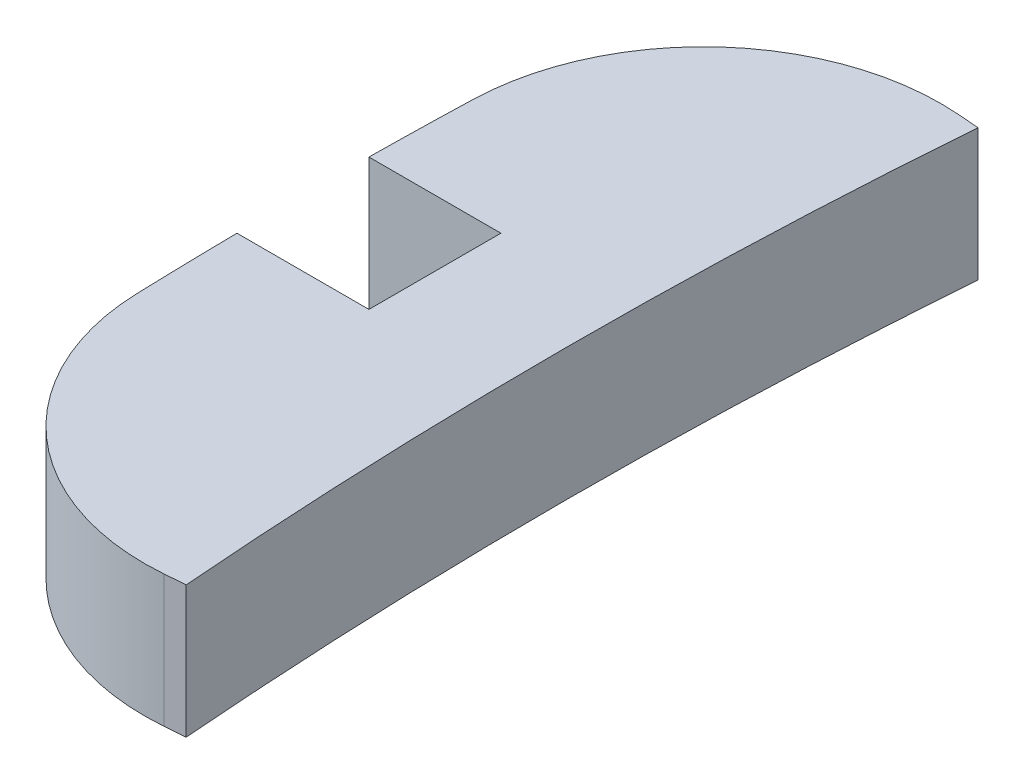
ISO-10303-21;
HEADER;
FILE_DESCRIPTION(('STEP AP214'),'2;1');
FILE_NAME('part.step','',(''),(''),'','','');
FILE_SCHEMA(('AUTOMOTIVE_DESIGN { 1 0 10303 214 1 1 1 1 }'));
ENDSEC;
DATA;
#1=APPLICATION_CONTEXT('core data for automotive mechanical design processes');
#2=APPLICATION_PROTOCOL_DEFINITION('international standard','automotive_design',2000,#1);
#3=PRODUCT_CONTEXT('',#1,'mechanical');
#4=PRODUCT('Part','Part','',(#3));
#5=PRODUCT_RELATED_PRODUCT_CATEGORY('part','',(#4));
#6=PRODUCT_DEFINITION_FORMATION('','',#4);
#7=PRODUCT_DEFINITION_CONTEXT('part definition',#1,'design');
#8=PRODUCT_DEFINITION('design','',#6,#7);
#9=PRODUCT_DEFINITION_SHAPE('','',#8);
#10=(LENGTH_UNIT() NAMED_UNIT(*) SI_UNIT(.MILLI.,.METRE.));
#11=(NAMED_UNIT(*) PLANE_ANGLE_UNIT() SI_UNIT($,.RADIAN.));
#12=(NAMED_UNIT(*) SI_UNIT($,.STERADIAN.) SOLID_ANGLE_UNIT());
#13=UNCERTAINTY_MEASURE_WITH_UNIT(LENGTH_MEASURE(1.E-05),#10,'distance_accuracy_value','');
#14=(GEOMETRIC_REPRESENTATION_CONTEXT(3) GLOBAL_UNCERTAINTY_ASSIGNED_CONTEXT((#13)) GLOBAL_UNIT_ASSIGNED_CONTEXT((#10,
#11,#12)) REPRESENTATION_CONTEXT('',''));
#15=CARTESIAN_POINT('',(0.,0.,0.));
#16=DIRECTION('',(0.,0.,1.));
#17=DIRECTION('',(1.,0.,0.));
#18=AXIS2_PLACEMENT_3D('',#15,#16,#17);
#19=CARTESIAN_POINT('',(-195.684428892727,5.,-2.5));
#20=DIRECTION('',(1.,0.,0.));
#21=DIRECTION('',(0.,0.,-1.));
#22=AXIS2_PLACEMENT_3D('',#19,#20,#21);
#23=PLANE('',#22);
#24=DIRECTION('',(0.,0.,1.));
#25=VECTOR('',#24,1.);
#26=CARTESIAN_POINT('',(-195.684428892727,0.,-2.5));
#27=LINE('',#26,#25);
#28=CARTESIAN_POINT('',(-195.684428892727,0.,-2.5));
#29=VERTEX_POINT('',#28);
#30=CARTESIAN_POINT('',(-195.684428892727,0.,2.5));
#31=VERTEX_POINT('',#30);
#32=EDGE_CURVE('E141',#29,#31,#27,.T.);
#33=ORIENTED_EDGE('',*,*,#32,.T.);
#34=DIRECTION('',(0.,-1.,0.));
#35=VECTOR('',#34,1.);
#36=CARTESIAN_POINT('',(-195.684428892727,5.,2.5));
#37=LINE('',#36,#35);
#38=CARTESIAN_POINT('',(-195.684428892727,5.,2.5));
#39=VERTEX_POINT('',#38);
#40=EDGE_CURVE('E11',#39,#31,#37,.T.);
#41=ORIENTED_EDGE('',*,*,#40,.F.);
#42=DIRECTION('',(0.,0.,1.));
#43=VECTOR('',#42,1.);
#44=CARTESIAN_POINT('',(-195.684428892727,5.,-2.5));
#45=LINE('',#44,#43);
#46=CARTESIAN_POINT('',(-195.684428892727,5.,-2.5));
#47=VERTEX_POINT('',#46);
#48=EDGE_CURVE('E159',#47,#39,#45,.T.);
#49=ORIENTED_EDGE('',*,*,#48,.F.);
#50=DIRECTION('',(0.,-1.,0.));
#51=VECTOR('',#50,1.);
#52=CARTESIAN_POINT('',(-195.684428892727,5.,-2.5));
#53=LINE('',#52,#51);
#54=EDGE_CURVE('E137',#47,#29,#53,.T.);
#55=ORIENTED_EDGE('',*,*,#54,.T.);
#56=EDGE_LOOP('',(#33,#41,#49,#55));
#57=FACE_BOUND('',#56,.T.);
#58=ADVANCED_FACE('F33',(#57),#23,.F.);
#59=CARTESIAN_POINT('',(-195.684428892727,5.,2.5));
#60=DIRECTION('',(0.,0.,1.));
#61=DIRECTION('',(1.,0.,0.));
#62=AXIS2_PLACEMENT_3D('',#59,#60,#61);
#63=PLANE('',#62);
#64=DIRECTION('',(-1.,0.,0.));
#65=VECTOR('',#64,1.);
#66=CARTESIAN_POINT('',(-195.684428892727,0.,2.5));
#67=LINE('',#66,#65);
#68=CARTESIAN_POINT('',(-200.684428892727,0.,2.49999999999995));
#69=VERTEX_POINT('',#68);
#70=EDGE_CURVE('E144',#31,#69,#67,.T.);
#71=ORIENTED_EDGE('',*,*,#70,.T.);
#72=DIRECTION('',(0.,-1.,0.));
#73=VECTOR('',#72,1.);
#74=CARTESIAN_POINT('',(-200.684428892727,5.,2.49999999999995));
#75=LINE('',#74,#73);
#76=CARTESIAN_POINT('',(-200.684428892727,5.,2.49999999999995));
#77=VERTEX_POINT('',#76);
#78=EDGE_CURVE('E41',#77,#69,#75,.T.);
#79=ORIENTED_EDGE('',*,*,#78,.F.);
#80=DIRECTION('',(-1.,0.,0.));
#81=VECTOR('',#80,1.);
#82=CARTESIAN_POINT('',(-195.684428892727,5.,2.5));
#83=LINE('',#82,#81);
#84=EDGE_CURVE('E98',#39,#77,#83,.T.);
#85=ORIENTED_EDGE('',*,*,#84,.F.);
#86=ORIENTED_EDGE('',*,*,#40,.T.);
#87=EDGE_LOOP('',(#71,#79,#85,#86));
#88=FACE_BOUND('',#87,.T.);
#89=ADVANCED_FACE('F208',(#88),#63,.F.);
#90=CARTESIAN_POINT('',(0.,5.,0.));
#91=DIRECTION('',(0.,-1.,0.));
#92=DIRECTION('',(0.,0.,-1.));
#93=AXIS2_PLACEMENT_3D('',#90,#91,#92);
#94=CYLINDRICAL_SURFACE('',#93,200.7);
#95=CARTESIAN_POINT('',(0.,0.,0.));
#96=DIRECTION('',(0.,1.,0.));
#97=DIRECTION('',(0.,0.,1.));
#98=AXIS2_PLACEMENT_3D('',#95,#96,#97);
#99=CIRCLE('',#98,200.7);
#100=CARTESIAN_POINT('',(-200.598700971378,0.,6.37582689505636));
#101=VERTEX_POINT('',#100);
#102=EDGE_CURVE('E146',#69,#101,#99,.T.);
#103=ORIENTED_EDGE('',*,*,#102,.T.);
#104=DIRECTION('',(0.,-1.,0.));
#105=VECTOR('',#104,1.);
#106=CARTESIAN_POINT('',(-200.598700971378,5.,6.37582689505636));
#107=LINE('',#106,#105);
#108=CARTESIAN_POINT('',(-200.598700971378,5.,6.37582689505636));
#109=VERTEX_POINT('',#108);
#110=EDGE_CURVE('E172',#109,#101,#107,.T.);
#111=ORIENTED_EDGE('',*,*,#110,.F.);
#112=CARTESIAN_POINT('',(0.,5.,0.));
#113=DIRECTION('',(0.,1.,0.));
#114=DIRECTION('',(0.,0.,1.));
#115=AXIS2_PLACEMENT_3D('',#112,#113,#114);
#116=CIRCLE('',#115,200.7);
#117=EDGE_CURVE('E180',#77,#109,#116,.T.);
#118=ORIENTED_EDGE('',*,*,#117,.F.);
#119=ORIENTED_EDGE('',*,*,#78,.T.);
#120=EDGE_LOOP('',(#103,#111,#118,#119));
#121=FACE_BOUND('',#120,.T.);
#122=ADVANCED_FACE('F178',(#121),#94,.T.);
#123=CARTESIAN_POINT('',(-191.603243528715,5.,6.08991537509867));
#124=DIRECTION('',(0.,-1.,0.));
#125=DIRECTION('',(0.,0.,-1.));
#126=AXIS2_PLACEMENT_3D('',#123,#124,#125);
#127=CYLINDRICAL_SURFACE('',#126,9.00000000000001);
#128=CARTESIAN_POINT('',(-191.603243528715,0.,6.08991537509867));
#129=DIRECTION('',(0.,1.,0.));
#130=DIRECTION('',(0.,0.,-1.));
#131=AXIS2_PLACEMENT_3D('',#128,#129,#130);
#132=CIRCLE('',#131,9.00000000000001);
#133=CARTESIAN_POINT('',(-190.895325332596,0.,15.0620306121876));
#134=VERTEX_POINT('',#133);
#135=EDGE_CURVE('E148',#101,#134,#132,.T.);
#136=ORIENTED_EDGE('',*,*,#135,.T.);
#137=DIRECTION('',(0.,-1.,0.));
#138=VECTOR('',#137,1.);
#139=CARTESIAN_POINT('',(-190.895325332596,5.,15.0620306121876));
#140=LINE('',#139,#138);
#141=CARTESIAN_POINT('',(-190.895325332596,5.,15.0620306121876));
#142=VERTEX_POINT('',#141);
#143=EDGE_CURVE('E169',#142,#134,#140,.T.);
#144=ORIENTED_EDGE('',*,*,#143,.F.);
#145=CARTESIAN_POINT('',(-191.603243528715,5.,6.08991537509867));
#146=DIRECTION('',(0.,1.,0.));
#147=DIRECTION('',(0.,0.,-1.));
#148=AXIS2_PLACEMENT_3D('',#145,#146,#147);
#149=CIRCLE('',#148,9.00000000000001);
#150=EDGE_CURVE('E198',#109,#142,#149,.T.);
#151=ORIENTED_EDGE('',*,*,#150,.F.);
#152=ORIENTED_EDGE('',*,*,#110,.T.);
#153=EDGE_LOOP('',(#136,#144,#151,#152));
#154=FACE_BOUND('',#153,.T.);
#155=ADVANCED_FACE('F189',(#154),#127,.T.);
#156=CARTESIAN_POINT('',(-190.895325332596,5.,15.0620306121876));
#157=DIRECTION('',(-0.078657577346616,0.,-0.996901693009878));
#158=DIRECTION('',(-0.996901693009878,0.,0.078657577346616));
#159=AXIS2_PLACEMENT_3D('',#156,#157,#158);
#160=PLANE('',#159);
#161=DIRECTION('',(0.996901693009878,0.,-0.078657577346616));
#162=VECTOR('',#161,1.);
#163=CARTESIAN_POINT('',(-190.895325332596,0.,15.0620306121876));
#164=LINE('',#163,#162);
#165=CARTESIAN_POINT('',(-190.109152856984,0.,15.));
#166=VERTEX_POINT('',#165);
#167=EDGE_CURVE('E150',#134,#166,#164,.T.);
#168=ORIENTED_EDGE('',*,*,#167,.T.);
#169=DIRECTION('',(0.,-1.,0.));
#170=VECTOR('',#169,1.);
#171=CARTESIAN_POINT('',(-190.109152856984,5.,15.));
#172=LINE('',#171,#170);
#173=CARTESIAN_POINT('',(-190.109152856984,5.,15.));
#174=VERTEX_POINT('',#173);
#175=EDGE_CURVE('E166',#174,#166,#172,.T.);
#176=ORIENTED_EDGE('',*,*,#175,.F.);
#177=DIRECTION('',(0.996901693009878,0.,-0.078657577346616));
#178=VECTOR('',#177,1.);
#179=CARTESIAN_POINT('',(-190.895325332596,5.,15.0620306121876));
#180=LINE('',#179,#178);
#181=EDGE_CURVE('E195',#142,#174,#180,.T.);
#182=ORIENTED_EDGE('',*,*,#181,.F.);
#183=ORIENTED_EDGE('',*,*,#143,.T.);
#184=EDGE_LOOP('',(#168,#176,#182,#183));
#185=FACE_BOUND('',#184,.T.);
#186=ADVANCED_FACE('F193',(#185),#160,.F.);
#187=CARTESIAN_POINT('',(0.,5.,0.));
#188=DIRECTION('',(0.,-1.,0.));
#189=DIRECTION('',(0.,0.,-1.));
#190=AXIS2_PLACEMENT_3D('',#187,#188,#189);
#191=CYLINDRICAL_SURFACE('',#190,190.7);
#192=CARTESIAN_POINT('',(0.,0.,0.));
#193=DIRECTION('',(0.,-1.,0.));
#194=DIRECTION('',(0.,0.,1.));
#195=AXIS2_PLACEMENT_3D('',#192,#193,#194);
#196=CIRCLE('',#195,190.7);
#197=CARTESIAN_POINT('',(-190.109152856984,0.,-15.));
#198=VERTEX_POINT('',#197);
#199=EDGE_CURVE('E152',#166,#198,#196,.T.);
#200=ORIENTED_EDGE('',*,*,#199,.T.);
#201=DIRECTION('',(0.,-1.,0.));
#202=VECTOR('',#201,1.);
#203=CARTESIAN_POINT('',(-190.109152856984,5.,-15.));
#204=LINE('',#203,#202);
#205=CARTESIAN_POINT('',(-190.109152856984,5.,-15.));
#206=VERTEX_POINT('',#205);
#207=EDGE_CURVE('E163',#206,#198,#204,.T.);
#208=ORIENTED_EDGE('',*,*,#207,.F.);
#209=CARTESIAN_POINT('',(0.,5.,0.));
#210=DIRECTION('',(0.,-1.,0.));
#211=DIRECTION('',(0.,0.,1.));
#212=AXIS2_PLACEMENT_3D('',#209,#210,#211);
#213=CIRCLE('',#212,190.7);
#214=EDGE_CURVE('E197',#174,#206,#213,.T.);
#215=ORIENTED_EDGE('',*,*,#214,.F.);
#216=ORIENTED_EDGE('',*,*,#175,.T.);
#217=EDGE_LOOP('',(#200,#208,#215,#216));
#218=FACE_BOUND('',#217,.T.);
#219=ADVANCED_FACE('F220',(#218),#191,.F.);
#220=CARTESIAN_POINT('',(-190.895325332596,5.,-15.0620306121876));
#221=DIRECTION('',(-0.078657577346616,0.,0.996901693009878));
#222=DIRECTION('',(0.996901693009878,0.,0.078657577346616));
#223=AXIS2_PLACEMENT_3D('',#220,#221,#222);
#224=PLANE('',#223);
#225=DIRECTION('',(-0.996901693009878,0.,-0.078657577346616));
#226=VECTOR('',#225,1.);
#227=CARTESIAN_POINT('',(-190.895325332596,0.,-15.0620306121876));
#228=LINE('',#227,#226);
#229=CARTESIAN_POINT('',(-190.895325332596,0.,-15.0620306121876));
#230=VERTEX_POINT('',#229);
#231=EDGE_CURVE('E154',#198,#230,#228,.T.);
#232=ORIENTED_EDGE('',*,*,#231,.T.);
#233=DIRECTION('',(0.,-1.,0.));
#234=VECTOR('',#233,1.);
#235=CARTESIAN_POINT('',(-190.895325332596,5.,-15.0620306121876));
#236=LINE('',#235,#234);
#237=CARTESIAN_POINT('',(-190.895325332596,5.,-15.0620306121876));
#238=VERTEX_POINT('',#237);
#239=EDGE_CURVE('E132',#238,#230,#236,.T.);
#240=ORIENTED_EDGE('',*,*,#239,.F.);
#241=DIRECTION('',(-0.996901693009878,0.,-0.078657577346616));
#242=VECTOR('',#241,1.);
#243=CARTESIAN_POINT('',(-190.895325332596,5.,-15.0620306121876));
#244=LINE('',#243,#242);
#245=EDGE_CURVE('E123',#206,#238,#244,.T.);
#246=ORIENTED_EDGE('',*,*,#245,.F.);
#247=ORIENTED_EDGE('',*,*,#207,.T.);
#248=EDGE_LOOP('',(#232,#240,#246,#247));
#249=FACE_BOUND('',#248,.T.);
#250=ADVANCED_FACE('F223',(#249),#224,.F.);
#251=CARTESIAN_POINT('',(-191.603243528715,5.,-6.08991537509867));
#252=DIRECTION('',(0.,-1.,0.));
#253=DIRECTION('',(0.,0.,-1.));
#254=AXIS2_PLACEMENT_3D('',#251,#252,#253);
#255=CYLINDRICAL_SURFACE('',#254,9.00000000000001);
#256=CARTESIAN_POINT('',(-191.603243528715,0.,-6.08991537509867));
#257=DIRECTION('',(0.,1.,0.));
#258=DIRECTION('',(0.,0.,1.));
#259=AXIS2_PLACEMENT_3D('',#256,#257,#258);
#260=CIRCLE('',#259,9.00000000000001);
#261=CARTESIAN_POINT('',(-200.598700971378,0.,-6.37582689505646));
#262=VERTEX_POINT('',#261);
#263=EDGE_CURVE('E131',#230,#262,#260,.T.);
#264=ORIENTED_EDGE('',*,*,#263,.T.);
#265=DIRECTION('',(0.,-1.,0.));
#266=VECTOR('',#265,1.);
#267=CARTESIAN_POINT('',(-200.598700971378,5.,-6.37582689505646));
#268=LINE('',#267,#266);
#269=CARTESIAN_POINT('',(-200.598700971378,5.,-6.37582689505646));
#270=VERTEX_POINT('',#269);
#271=EDGE_CURVE('E128',#270,#262,#268,.T.);
#272=ORIENTED_EDGE('',*,*,#271,.F.);
#273=CARTESIAN_POINT('',(-191.603243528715,5.,-6.08991537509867));
#274=DIRECTION('',(0.,1.,0.));
#275=DIRECTION('',(0.,0.,1.));
#276=AXIS2_PLACEMENT_3D('',#273,#274,#275);
#277=CIRCLE('',#276,9.00000000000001);
#278=EDGE_CURVE('E117',#238,#270,#277,.T.);
#279=ORIENTED_EDGE('',*,*,#278,.F.);
#280=ORIENTED_EDGE('',*,*,#239,.T.);
#281=EDGE_LOOP('',(#264,#272,#279,#280));
#282=FACE_BOUND('',#281,.T.);
#283=ADVANCED_FACE('F129',(#282),#255,.T.);
#284=CARTESIAN_POINT('',(0.,5.,0.));
#285=DIRECTION('',(0.,-1.,0.));
#286=DIRECTION('',(0.,0.,-1.));
#287=AXIS2_PLACEMENT_3D('',#284,#285,#286);
#288=CYLINDRICAL_SURFACE('',#287,200.7);
#289=CARTESIAN_POINT('',(0.,0.,0.));
#290=DIRECTION('',(0.,1.,0.));
#291=DIRECTION('',(0.,0.,1.));
#292=AXIS2_PLACEMENT_3D('',#289,#290,#291);
#293=CIRCLE('',#292,200.7);
#294=CARTESIAN_POINT('',(-200.684428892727,0.,-2.5));
#295=VERTEX_POINT('',#294);
#296=EDGE_CURVE('E84',#262,#295,#293,.T.);
#297=ORIENTED_EDGE('',*,*,#296,.T.);
#298=DIRECTION('',(0.,-1.,0.));
#299=VECTOR('',#298,1.);
#300=CARTESIAN_POINT('',(-200.684428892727,5.,-2.5));
#301=LINE('',#300,#299);
#302=CARTESIAN_POINT('',(-200.684428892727,5.,-2.5));
#303=VERTEX_POINT('',#302);
#304=EDGE_CURVE('E133',#303,#295,#301,.T.);
#305=ORIENTED_EDGE('',*,*,#304,.F.);
#306=CARTESIAN_POINT('',(0.,5.,0.));
#307=DIRECTION('',(0.,1.,0.));
#308=DIRECTION('',(0.,0.,1.));
#309=AXIS2_PLACEMENT_3D('',#306,#307,#308);
#310=CIRCLE('',#309,200.7);
#311=EDGE_CURVE('E121',#270,#303,#310,.T.);
#312=ORIENTED_EDGE('',*,*,#311,.F.);
#313=ORIENTED_EDGE('',*,*,#271,.T.);
#314=EDGE_LOOP('',(#297,#305,#312,#313));
#315=FACE_BOUND('',#314,.T.);
#316=ADVANCED_FACE('F135',(#315),#288,.T.);
#317=CARTESIAN_POINT('',(-195.684428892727,5.,-2.5));
#318=DIRECTION('',(0.,0.,-1.));
#319=DIRECTION('',(-1.,0.,0.));
#320=AXIS2_PLACEMENT_3D('',#317,#318,#319);
#321=PLANE('',#320);
#322=DIRECTION('',(1.,0.,0.));
#323=VECTOR('',#322,1.);
#324=CARTESIAN_POINT('',(-195.684428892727,0.,-2.5));
#325=LINE('',#324,#323);
#326=EDGE_CURVE('E90',#295,#29,#325,.T.);
#327=ORIENTED_EDGE('',*,*,#326,.T.);
#328=ORIENTED_EDGE('',*,*,#54,.F.);
#329=DIRECTION('',(1.,0.,0.));
#330=VECTOR('',#329,1.);
#331=CARTESIAN_POINT('',(-195.684428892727,5.,-2.5));
#332=LINE('',#331,#330);
#333=EDGE_CURVE('E49',#303,#47,#332,.T.);
#334=ORIENTED_EDGE('',*,*,#333,.F.);
#335=ORIENTED_EDGE('',*,*,#304,.T.);
#336=EDGE_LOOP('',(#327,#328,#334,#335));
#337=FACE_BOUND('',#336,.T.);
#338=ADVANCED_FACE('F232',(#337),#321,.F.);
#339=CARTESIAN_POINT('',(0.,5.,0.));
#340=DIRECTION('',(0.,1.,0.));
#341=DIRECTION('',(0.,0.,1.));
#342=AXIS2_PLACEMENT_3D('',#339,#340,#341);
#343=PLANE('',#342);
#344=ORIENTED_EDGE('',*,*,#48,.T.);
#345=ORIENTED_EDGE('',*,*,#84,.T.);
#346=ORIENTED_EDGE('',*,*,#117,.T.);
#347=ORIENTED_EDGE('',*,*,#150,.T.);
#348=ORIENTED_EDGE('',*,*,#181,.T.);
#349=ORIENTED_EDGE('',*,*,#214,.T.);
#350=ORIENTED_EDGE('',*,*,#245,.T.);
#351=ORIENTED_EDGE('',*,*,#278,.T.);
#352=ORIENTED_EDGE('',*,*,#311,.T.);
#353=ORIENTED_EDGE('',*,*,#333,.T.);
#354=EDGE_LOOP('',(#344,#345,#346,#347,#348,#349,#350,#351,#352,#353));
#355=FACE_BOUND('',#354,.T.);
#356=ADVANCED_FACE('F119',(#355),#343,.T.);
#357=CARTESIAN_POINT('',(0.,0.,0.));
#358=DIRECTION('',(0.,1.,0.));
#359=DIRECTION('',(0.,0.,1.));
#360=AXIS2_PLACEMENT_3D('',#357,#358,#359);
#361=PLANE('',#360);
#362=ORIENTED_EDGE('',*,*,#32,.F.);
#363=ORIENTED_EDGE('',*,*,#326,.F.);
#364=ORIENTED_EDGE('',*,*,#296,.F.);
#365=ORIENTED_EDGE('',*,*,#263,.F.);
#366=ORIENTED_EDGE('',*,*,#231,.F.);
#367=ORIENTED_EDGE('',*,*,#199,.F.);
#368=ORIENTED_EDGE('',*,*,#167,.F.);
#369=ORIENTED_EDGE('',*,*,#135,.F.);
#370=ORIENTED_EDGE('',*,*,#102,.F.);
#371=ORIENTED_EDGE('',*,*,#70,.F.);
#372=EDGE_LOOP('',(#362,#363,#364,#365,#366,#367,#368,#369,#370,#371));
#373=FACE_BOUND('',#372,.T.);
#374=ADVANCED_FACE('F184',(#373),#361,.F.);
#375=CLOSED_SHELL('',(#58,#89,#122,#155,#186,#219,#250,#283,#316,#338,#356,#374));
#376=MANIFOLD_SOLID_BREP('B2',#375);
#377=ADVANCED_BREP_SHAPE_REPRESENTATION('',(#18,#376),#14);
#378=SHAPE_DEFINITION_REPRESENTATION(#9,#377);
ENDSEC;
END-ISO-10303-21;
